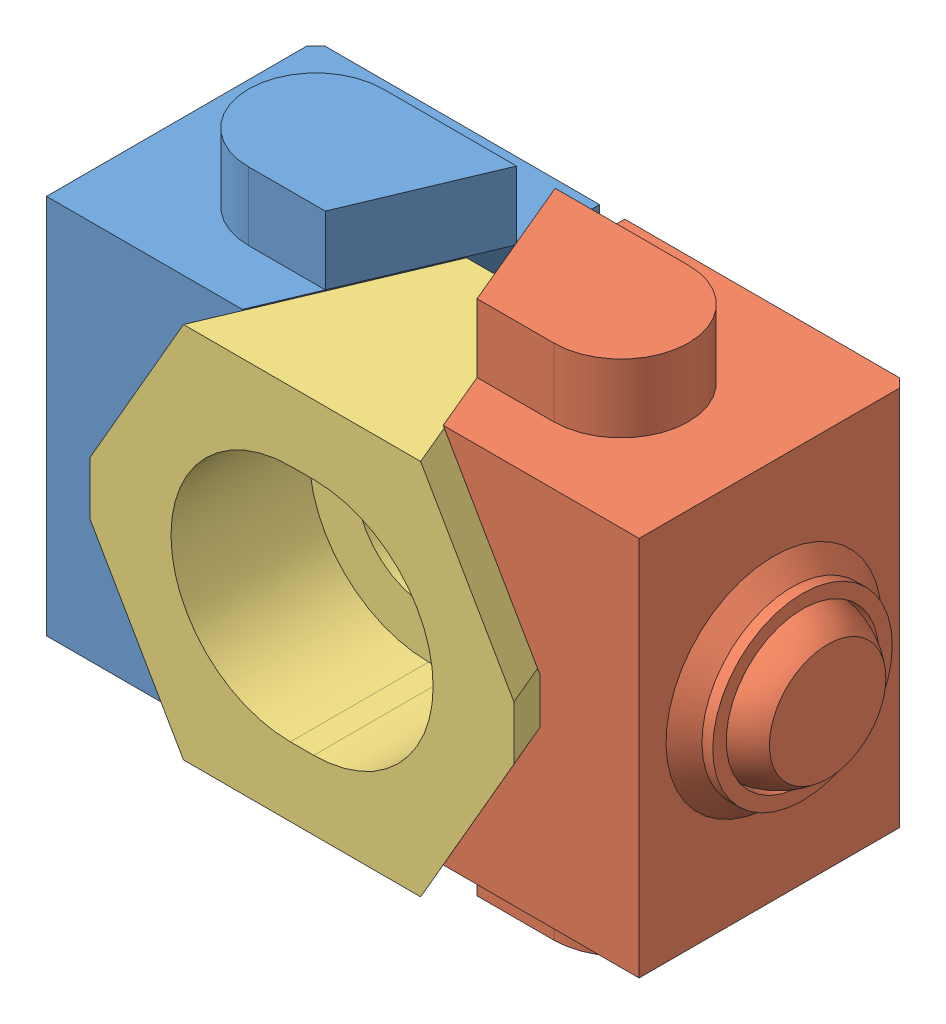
SolidWorks assembly BK2-VT-P.SLDASM, configuration Default (file format 15000). Lengths in mm.
Overall size (39 28.8 17.27).
3 component instances, 3 part files, 0 mates.
Components (placement in the parent):
- BK2-VT-P_01-1: BK2-VT-P_01.SLDPRT [Default] at (-13.5 0 0) x (1 0 0) z (0 0 -1) size (18.8 28.8 15)
- BK2-VT-P_02-1: BK2-VT-P_02.SLDPRT [Default] at (13.5 0 0) x (-1 0 0) z (0 0 -1) size (18.8 28.8 15)
- BK2-VT-P_03-1: BK2-VT-P_03.SLDPRT [Default] at (0 0 6.1702) x (-1 0 0) z (0 0 1) size (23.6 21 11.1)
